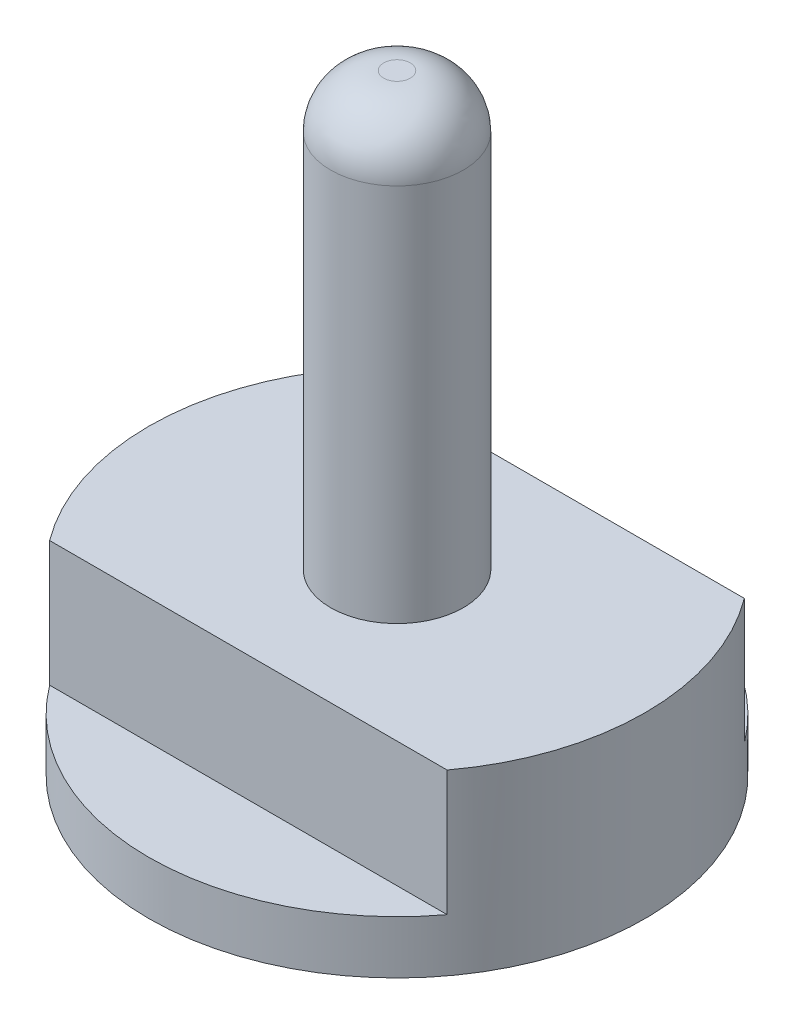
from build123d import *

# Parameters (mm, degrees)
BASE_EXTRUDE_DEPTH  = 3.36
SKETCH3_R           = 1.25
BOSS_EXTRUDE1_DEPTH = 8.14
FILLET1_R           = 1
BOSS_EXTRUDE2_START = -1
SKETCH4_R           = 4.675
BOSS_EXTRUDE2_DEPTH = 1
SKETCH5_R           = 1.675
SKETCH5_R_2         = 1.175
BOSS_EXTRUDE3_DEPTH = 2


with BuildPart() as part:
    # Sketch2 → Base-Extrude (new body)
    with BuildSketch(Plane(origin=(0, 3.36, 0), x_dir=(-1, 0, 0), z_dir=(0, 1, 0))):
        with BuildLine():
            Line((-3.743744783, 0), (3.743744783, 0))
            ThreePointArc((3.743744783, 0), (4.675, 2.8), (3.743744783, 5.6))
            Line((3.743744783, 5.6), (-3.743744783, 5.6))
            ThreePointArc((-3.743744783, 5.6), (-4.675, 2.8), (-3.743744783, 0))
        make_face()
    extrude(amount=-BASE_EXTRUDE_DEPTH)

    # Sketch3 → Boss-Extrude1 (add)
    with BuildSketch(Plane(origin=(0, 3.36, 0), x_dir=(-1, 0, 0), z_dir=(0, 1, 0))):
        with Locations(Location((0, 2.8, 0), (0, 0, 90))):
            Circle(SKETCH3_R)
    extrude(amount=BOSS_EXTRUDE1_DEPTH)

    # Fillet1
    fillet1_edges = [part.edges().sort_by_distance(p)[0] for p in [
        (0, 11.5, 1.55),
    ]]
    fillet(fillet1_edges, radius=FILLET1_R)

    # Sketch4 → Boss-Extrude2 (add)
    with BuildSketch(Plane.XZ.offset(BOSS_EXTRUDE2_START)):
        with Locations(Location((0, 2.8, 0), (0, 0, 90))):
            Circle(SKETCH4_R)
    extrude(amount=BOSS_EXTRUDE2_DEPTH)

    # Sketch5 → Boss-Extrude3 (add)
    with BuildSketch(Plane.XZ):
        with Locations(Location((0, 2.8, 0), (0, 0, 270))):
            Circle(SKETCH5_R)
        with Locations(Location((0, 2.8, 0), (0, 0, 270))):
            Circle(SKETCH5_R_2, mode=Mode.SUBTRACT)
    extrude(amount=BOSS_EXTRUDE3_DEPTH)


solid = part.part
